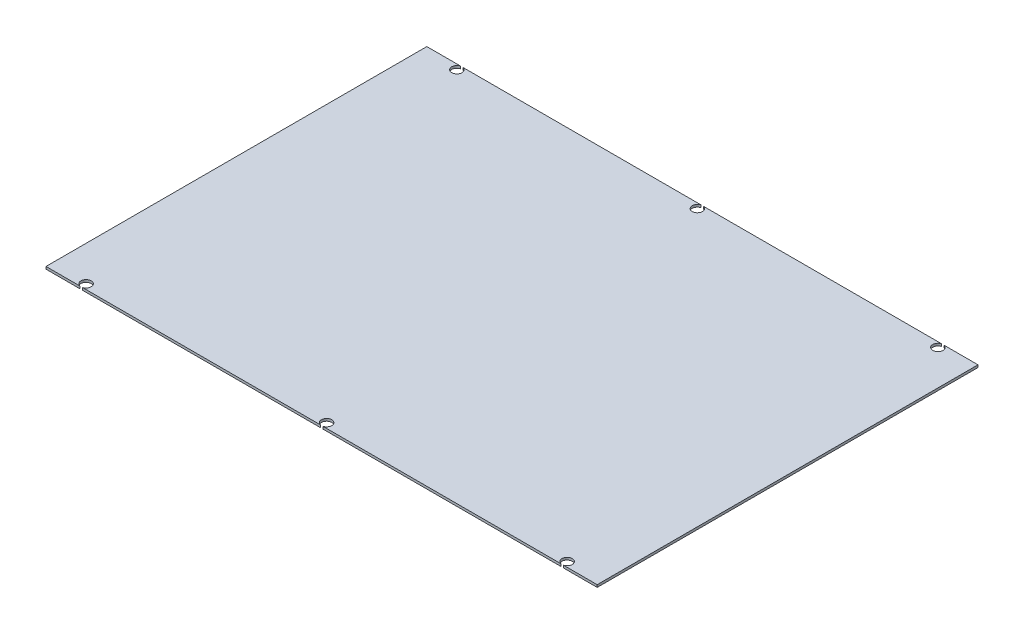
ISO-10303-21;
HEADER;
FILE_DESCRIPTION(('STEP AP214'),'2;1');
FILE_NAME('part.step','',(''),(''),'','','');
FILE_SCHEMA(('AUTOMOTIVE_DESIGN { 1 0 10303 214 1 1 1 1 }'));
ENDSEC;
DATA;
#1=APPLICATION_CONTEXT('core data for automotive mechanical design processes');
#2=APPLICATION_PROTOCOL_DEFINITION('international standard','automotive_design',2000,#1);
#3=PRODUCT_CONTEXT('',#1,'mechanical');
#4=PRODUCT('Part','Part','',(#3));
#5=PRODUCT_RELATED_PRODUCT_CATEGORY('part','',(#4));
#6=PRODUCT_DEFINITION_FORMATION('','',#4);
#7=PRODUCT_DEFINITION_CONTEXT('part definition',#1,'design');
#8=PRODUCT_DEFINITION('design','',#6,#7);
#9=PRODUCT_DEFINITION_SHAPE('','',#8);
#10=(LENGTH_UNIT() NAMED_UNIT(*) SI_UNIT(.MILLI.,.METRE.));
#11=(NAMED_UNIT(*) PLANE_ANGLE_UNIT() SI_UNIT($,.RADIAN.));
#12=(NAMED_UNIT(*) SI_UNIT($,.STERADIAN.) SOLID_ANGLE_UNIT());
#13=UNCERTAINTY_MEASURE_WITH_UNIT(LENGTH_MEASURE(1.E-05),#10,'distance_accuracy_value','');
#14=(GEOMETRIC_REPRESENTATION_CONTEXT(3) GLOBAL_UNCERTAINTY_ASSIGNED_CONTEXT((#13)) GLOBAL_UNIT_ASSIGNED_CONTEXT((#10,
#11,#12)) REPRESENTATION_CONTEXT('',''));
#15=CARTESIAN_POINT('',(0.,0.,0.));
#16=DIRECTION('',(0.,0.,1.));
#17=DIRECTION('',(1.,0.,0.));
#18=AXIS2_PLACEMENT_3D('',#15,#16,#17);
#19=CARTESIAN_POINT('',(0.,0.761999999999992,0.));
#20=DIRECTION('',(0.,0.,-1.));
#21=DIRECTION('',(-1.,0.,0.));
#22=AXIS2_PLACEMENT_3D('',#19,#20,#21);
#23=PLANE('',#22);
#24=DIRECTION('',(1.,0.,0.));
#25=VECTOR('',#24,1.);
#26=CARTESIAN_POINT('',(0.,0.,0.));
#27=LINE('',#26,#25);
#28=CARTESIAN_POINT('',(0.,0.,0.));
#29=VERTEX_POINT('',#28);
#30=CARTESIAN_POINT('',(10.7342083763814,0.,0.));
#31=VERTEX_POINT('',#30);
#32=EDGE_CURVE('E179',#29,#31,#27,.T.);
#33=ORIENTED_EDGE('',*,*,#32,.T.);
#34=DIRECTION('',(0.,1.,0.));
#35=VECTOR('',#34,1.);
#36=CARTESIAN_POINT('',(10.7342083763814,0.761999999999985,0.));
#37=LINE('',#36,#35);
#38=CARTESIAN_POINT('',(10.7342083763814,0.761999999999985,0.));
#39=VERTEX_POINT('',#38);
#40=EDGE_CURVE('E44',#31,#39,#37,.T.);
#41=ORIENTED_EDGE('',*,*,#40,.T.);
#42=DIRECTION('',(1.,0.,0.));
#43=VECTOR('',#42,1.);
#44=CARTESIAN_POINT('',(0.,0.761999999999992,0.));
#45=LINE('',#44,#43);
#46=CARTESIAN_POINT('',(0.,0.761999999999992,0.));
#47=VERTEX_POINT('',#46);
#48=EDGE_CURVE('E154',#47,#39,#45,.T.);
#49=ORIENTED_EDGE('',*,*,#48,.F.);
#50=DIRECTION('',(0.,-1.,0.));
#51=VECTOR('',#50,1.);
#52=CARTESIAN_POINT('',(0.,0.761999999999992,0.));
#53=LINE('',#52,#51);
#54=EDGE_CURVE('E198',#47,#29,#53,.T.);
#55=ORIENTED_EDGE('',*,*,#54,.T.);
#56=EDGE_LOOP('',(#33,#41,#49,#55));
#57=FACE_BOUND('',#56,.T.);
#58=ADVANCED_FACE('F30',(#57),#23,.F.);
#59=CARTESIAN_POINT('',(11.4907916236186,0.761999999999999,-4.44089209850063E-13));
#60=VERTEX_POINT('',#59);
#61=CARTESIAN_POINT('',(86.9342083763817,0.761999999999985,0.));
#62=VERTEX_POINT('',#61);
#63=EDGE_CURVE('E151',#60,#62,#45,.T.);
#64=ORIENTED_EDGE('',*,*,#63,.F.);
#65=DIRECTION('',(0.,1.,0.));
#66=VECTOR('',#65,1.);
#67=CARTESIAN_POINT('',(11.4907916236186,0.762000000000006,-4.44089209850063E-13));
#68=LINE('',#67,#66);
#69=CARTESIAN_POINT('',(11.4907916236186,0.,0.));
#70=VERTEX_POINT('',#69);
#71=EDGE_CURVE('E141',#60,#70,#68,.F.);
#72=ORIENTED_EDGE('',*,*,#71,.T.);
#73=CARTESIAN_POINT('',(86.9342083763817,0.,0.));
#74=VERTEX_POINT('',#73);
#75=EDGE_CURVE('E52',#70,#74,#27,.T.);
#76=ORIENTED_EDGE('',*,*,#75,.T.);
#77=DIRECTION('',(0.,1.,0.));
#78=VECTOR('',#77,1.);
#79=CARTESIAN_POINT('',(86.9342083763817,0.761999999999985,0.));
#80=LINE('',#79,#78);
#81=EDGE_CURVE('E157',#74,#62,#80,.T.);
#82=ORIENTED_EDGE('',*,*,#81,.T.);
#83=EDGE_LOOP('',(#64,#72,#76,#82));
#84=FACE_BOUND('',#83,.T.);
#85=ADVANCED_FACE('F156',(#84),#23,.F.);
#86=CARTESIAN_POINT('',(87.6907916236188,0.761999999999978,0.));
#87=VERTEX_POINT('',#86);
#88=CARTESIAN_POINT('',(163.134208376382,0.762000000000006,0.));
#89=VERTEX_POINT('',#88);
#90=EDGE_CURVE('E158',#87,#89,#45,.T.);
#91=ORIENTED_EDGE('',*,*,#90,.F.);
#92=DIRECTION('',(0.,1.,0.));
#93=VECTOR('',#92,1.);
#94=CARTESIAN_POINT('',(87.6907916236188,0.761999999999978,0.));
#95=LINE('',#94,#93);
#96=CARTESIAN_POINT('',(87.6907916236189,0.,0.));
#97=VERTEX_POINT('',#96);
#98=EDGE_CURVE('E212',#87,#97,#95,.F.);
#99=ORIENTED_EDGE('',*,*,#98,.T.);
#100=CARTESIAN_POINT('',(163.134208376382,0.,0.));
#101=VERTEX_POINT('',#100);
#102=EDGE_CURVE('E219',#97,#101,#27,.T.);
#103=ORIENTED_EDGE('',*,*,#102,.T.);
#104=DIRECTION('',(0.,1.,0.));
#105=VECTOR('',#104,1.);
#106=CARTESIAN_POINT('',(163.134208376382,0.762000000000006,0.));
#107=LINE('',#106,#105);
#108=EDGE_CURVE('E266',#101,#89,#107,.T.);
#109=ORIENTED_EDGE('',*,*,#108,.T.);
#110=EDGE_LOOP('',(#91,#99,#103,#109));
#111=FACE_BOUND('',#110,.T.);
#112=ADVANCED_FACE('F217',(#111),#23,.F.);
#113=CARTESIAN_POINT('',(0.,0.761999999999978,-120.65));
#114=DIRECTION('',(0.,0.,1.));
#115=DIRECTION('',(1.,0.,0.));
#116=AXIS2_PLACEMENT_3D('',#113,#114,#115);
#117=PLANE('',#116);
#118=DIRECTION('',(-1.,0.,0.));
#119=VECTOR('',#118,1.);
#120=CARTESIAN_POINT('',(0.,0.,-120.65));
#121=LINE('',#120,#119);
#122=CARTESIAN_POINT('',(163.134208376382,0.,-120.65));
#123=VERTEX_POINT('',#122);
#124=CARTESIAN_POINT('',(87.690791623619,0.,-120.65));
#125=VERTEX_POINT('',#124);
#126=EDGE_CURVE('E188',#123,#125,#121,.T.);
#127=ORIENTED_EDGE('',*,*,#126,.T.);
#128=DIRECTION('',(0.,1.,0.));
#129=VECTOR('',#128,1.);
#130=CARTESIAN_POINT('',(87.6907916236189,0.76200000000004,-120.65));
#131=LINE('',#130,#129);
#132=CARTESIAN_POINT('',(87.6907916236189,0.76200000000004,-120.65));
#133=VERTEX_POINT('',#132);
#134=EDGE_CURVE('E273',#125,#133,#131,.T.);
#135=ORIENTED_EDGE('',*,*,#134,.T.);
#136=DIRECTION('',(-1.,0.,0.));
#137=VECTOR('',#136,1.);
#138=CARTESIAN_POINT('',(0.,0.761999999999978,-120.65));
#139=LINE('',#138,#137);
#140=CARTESIAN_POINT('',(163.134208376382,0.761999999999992,-120.65));
#141=VERTEX_POINT('',#140);
#142=EDGE_CURVE('E172',#141,#133,#139,.T.);
#143=ORIENTED_EDGE('',*,*,#142,.F.);
#144=DIRECTION('',(0.,1.,0.));
#145=VECTOR('',#144,1.);
#146=CARTESIAN_POINT('',(163.134208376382,0.761999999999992,-120.65));
#147=LINE('',#146,#145);
#148=EDGE_CURVE('E277',#141,#123,#147,.F.);
#149=ORIENTED_EDGE('',*,*,#148,.T.);
#150=EDGE_LOOP('',(#127,#135,#143,#149));
#151=FACE_BOUND('',#150,.T.);
#152=ADVANCED_FACE('F300',(#151),#117,.F.);
#153=CARTESIAN_POINT('',(174.625000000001,0.,-120.65));
#154=VERTEX_POINT('',#153);
#155=CARTESIAN_POINT('',(163.890791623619,0.,-120.65));
#156=VERTEX_POINT('',#155);
#157=EDGE_CURVE('E185',#154,#156,#121,.T.);
#158=ORIENTED_EDGE('',*,*,#157,.T.);
#159=DIRECTION('',(0.,1.,0.));
#160=VECTOR('',#159,1.);
#161=CARTESIAN_POINT('',(163.890791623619,0.761999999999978,-120.65));
#162=LINE('',#161,#160);
#163=CARTESIAN_POINT('',(163.890791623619,0.761999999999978,-120.65));
#164=VERTEX_POINT('',#163);
#165=EDGE_CURVE('E244',#156,#164,#162,.T.);
#166=ORIENTED_EDGE('',*,*,#165,.T.);
#167=CARTESIAN_POINT('',(174.625000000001,0.761999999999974,-120.65));
#168=VERTEX_POINT('',#167);
#169=EDGE_CURVE('E168',#168,#164,#139,.T.);
#170=ORIENTED_EDGE('',*,*,#169,.F.);
#171=DIRECTION('',(0.,-1.,0.));
#172=VECTOR('',#171,1.);
#173=CARTESIAN_POINT('',(174.625000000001,0.761999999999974,-120.65));
#174=LINE('',#173,#172);
#175=EDGE_CURVE('E192',#168,#154,#174,.T.);
#176=ORIENTED_EDGE('',*,*,#175,.T.);
#177=EDGE_LOOP('',(#158,#166,#170,#176));
#178=FACE_BOUND('',#177,.T.);
#179=ADVANCED_FACE('F242',(#178),#117,.F.);
#180=CARTESIAN_POINT('',(86.9342083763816,0.761999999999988,-120.65));
#181=VERTEX_POINT('',#180);
#182=CARTESIAN_POINT('',(11.4907916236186,0.761999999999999,-120.65));
#183=VERTEX_POINT('',#182);
#184=EDGE_CURVE('E173',#181,#183,#139,.T.);
#185=ORIENTED_EDGE('',*,*,#184,.F.);
#186=DIRECTION('',(0.,1.,0.));
#187=VECTOR('',#186,1.);
#188=CARTESIAN_POINT('',(86.9342083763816,0.761999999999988,-120.65));
#189=LINE('',#188,#187);
#190=CARTESIAN_POINT('',(86.9342083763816,0.,-120.65));
#191=VERTEX_POINT('',#190);
#192=EDGE_CURVE('E270',#181,#191,#189,.F.);
#193=ORIENTED_EDGE('',*,*,#192,.T.);
#194=CARTESIAN_POINT('',(11.4907916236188,0.,-120.65));
#195=VERTEX_POINT('',#194);
#196=EDGE_CURVE('E189',#191,#195,#121,.T.);
#197=ORIENTED_EDGE('',*,*,#196,.T.);
#198=DIRECTION('',(0.,1.,0.));
#199=VECTOR('',#198,1.);
#200=CARTESIAN_POINT('',(11.4907916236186,0.761999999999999,-120.65));
#201=LINE('',#200,#199);
#202=EDGE_CURVE('E178',#195,#183,#201,.T.);
#203=ORIENTED_EDGE('',*,*,#202,.T.);
#204=EDGE_LOOP('',(#185,#193,#197,#203));
#205=FACE_BOUND('',#204,.T.);
#206=ADVANCED_FACE('F290',(#205),#117,.F.);
#207=CARTESIAN_POINT('',(0.,0.761999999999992,0.));
#208=DIRECTION('',(1.,0.,0.));
#209=DIRECTION('',(0.,0.,-1.));
#210=AXIS2_PLACEMENT_3D('',#207,#208,#209);
#211=PLANE('',#210);
#212=DIRECTION('',(0.,0.,1.));
#213=VECTOR('',#212,1.);
#214=CARTESIAN_POINT('',(0.,0.,0.));
#215=LINE('',#214,#213);
#216=CARTESIAN_POINT('',(0.,0.,-120.65));
#217=VERTEX_POINT('',#216);
#218=EDGE_CURVE('E174',#217,#29,#215,.T.);
#219=ORIENTED_EDGE('',*,*,#218,.T.);
#220=ORIENTED_EDGE('',*,*,#54,.F.);
#221=DIRECTION('',(0.,0.,1.));
#222=VECTOR('',#221,1.);
#223=CARTESIAN_POINT('',(0.,0.761999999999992,0.));
#224=LINE('',#223,#222);
#225=CARTESIAN_POINT('',(0.,0.761999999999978,-120.65));
#226=VERTEX_POINT('',#225);
#227=EDGE_CURVE('E164',#226,#47,#224,.T.);
#228=ORIENTED_EDGE('',*,*,#227,.F.);
#229=DIRECTION('',(0.,-1.,0.));
#230=VECTOR('',#229,1.);
#231=CARTESIAN_POINT('',(0.,0.761999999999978,-120.65));
#232=LINE('',#231,#230);
#233=EDGE_CURVE('E171',#226,#217,#232,.T.);
#234=ORIENTED_EDGE('',*,*,#233,.T.);
#235=EDGE_LOOP('',(#219,#220,#228,#234));
#236=FACE_BOUND('',#235,.T.);
#237=ADVANCED_FACE('F32',(#236),#211,.F.);
#238=CARTESIAN_POINT('',(163.890791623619,0.761999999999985,0.));
#239=VERTEX_POINT('',#238);
#240=CARTESIAN_POINT('',(174.625000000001,0.761999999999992,0.));
#241=VERTEX_POINT('',#240);
#242=EDGE_CURVE('E161',#239,#241,#45,.T.);
#243=ORIENTED_EDGE('',*,*,#242,.F.);
#244=DIRECTION('',(0.,1.,0.));
#245=VECTOR('',#244,1.);
#246=CARTESIAN_POINT('',(163.890791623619,0.761999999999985,0.));
#247=LINE('',#246,#245);
#248=CARTESIAN_POINT('',(163.890791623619,0.,0.));
#249=VERTEX_POINT('',#248);
#250=EDGE_CURVE('E232',#239,#249,#247,.F.);
#251=ORIENTED_EDGE('',*,*,#250,.T.);
#252=CARTESIAN_POINT('',(174.625000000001,0.,-4.44089209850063E-13));
#253=VERTEX_POINT('',#252);
#254=EDGE_CURVE('E177',#249,#253,#27,.T.);
#255=ORIENTED_EDGE('',*,*,#254,.T.);
#256=DIRECTION('',(0.,-1.,0.));
#257=VECTOR('',#256,1.);
#258=CARTESIAN_POINT('',(174.625000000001,0.761999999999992,0.));
#259=LINE('',#258,#257);
#260=EDGE_CURVE('E195',#241,#253,#259,.T.);
#261=ORIENTED_EDGE('',*,*,#260,.F.);
#262=EDGE_LOOP('',(#243,#251,#255,#261));
#263=FACE_BOUND('',#262,.T.);
#264=ADVANCED_FACE('F230',(#263),#23,.F.);
#265=CARTESIAN_POINT('',(174.625000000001,0.761999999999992,0.));
#266=DIRECTION('',(-1.,0.,0.));
#267=DIRECTION('',(0.,0.,1.));
#268=AXIS2_PLACEMENT_3D('',#265,#266,#267);
#269=PLANE('',#268);
#270=DIRECTION('',(0.,0.,-1.));
#271=VECTOR('',#270,1.);
#272=CARTESIAN_POINT('',(174.625000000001,0.,-4.44089209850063E-13));
#273=LINE('',#272,#271);
#274=EDGE_CURVE('E182',#253,#154,#273,.T.);
#275=ORIENTED_EDGE('',*,*,#274,.T.);
#276=ORIENTED_EDGE('',*,*,#175,.F.);
#277=DIRECTION('',(0.,0.,-1.));
#278=VECTOR('',#277,1.);
#279=CARTESIAN_POINT('',(174.625000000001,0.761999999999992,0.));
#280=LINE('',#279,#278);
#281=EDGE_CURVE('E160',#241,#168,#280,.T.);
#282=ORIENTED_EDGE('',*,*,#281,.F.);
#283=ORIENTED_EDGE('',*,*,#260,.T.);
#284=EDGE_LOOP('',(#275,#276,#282,#283));
#285=FACE_BOUND('',#284,.T.);
#286=ADVANCED_FACE('F235',(#285),#269,.F.);
#287=CARTESIAN_POINT('',(10.7342083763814,0.761999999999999,-120.65));
#288=VERTEX_POINT('',#287);
#289=EDGE_CURVE('E167',#288,#226,#139,.T.);
#290=ORIENTED_EDGE('',*,*,#289,.F.);
#291=DIRECTION('',(0.,1.,0.));
#292=VECTOR('',#291,1.);
#293=CARTESIAN_POINT('',(10.7342083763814,0.761999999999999,-120.65));
#294=LINE('',#293,#292);
#295=CARTESIAN_POINT('',(10.7342083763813,0.,-120.65));
#296=VERTEX_POINT('',#295);
#297=EDGE_CURVE('E284',#288,#296,#294,.F.);
#298=ORIENTED_EDGE('',*,*,#297,.T.);
#299=EDGE_CURVE('E184',#296,#217,#121,.T.);
#300=ORIENTED_EDGE('',*,*,#299,.T.);
#301=ORIENTED_EDGE('',*,*,#233,.F.);
#302=EDGE_LOOP('',(#290,#298,#300,#301));
#303=FACE_BOUND('',#302,.T.);
#304=ADVANCED_FACE('F304',(#303),#117,.F.);
#305=CARTESIAN_POINT('',(0.,0.761999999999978,-120.65));
#306=DIRECTION('',(0.,-1.,0.));
#307=DIRECTION('',(0.,0.,-1.));
#308=AXIS2_PLACEMENT_3D('',#305,#306,#307);
#309=PLANE('',#308);
#310=ORIENTED_EDGE('',*,*,#48,.T.);
#311=CARTESIAN_POINT('',(11.1125,0.762000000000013,-1.58750000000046));
#312=DIRECTION('',(0.,1.,0.));
#313=DIRECTION('',(0.,0.,1.));
#314=AXIS2_PLACEMENT_3D('',#311,#312,#313);
#315=CIRCLE('',#314,1.63195);
#316=EDGE_CURVE('E144',#60,#39,#315,.T.);
#317=ORIENTED_EDGE('',*,*,#316,.F.);
#318=ORIENTED_EDGE('',*,*,#63,.T.);
#319=CARTESIAN_POINT('',(87.3125000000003,0.761999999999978,-1.58750000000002));
#320=DIRECTION('',(0.,1.,0.));
#321=DIRECTION('',(0.,0.,1.));
#322=AXIS2_PLACEMENT_3D('',#319,#320,#321);
#323=CIRCLE('',#322,1.63194999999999);
#324=EDGE_CURVE('E221',#87,#62,#323,.T.);
#325=ORIENTED_EDGE('',*,*,#324,.F.);
#326=ORIENTED_EDGE('',*,*,#90,.T.);
#327=CARTESIAN_POINT('',(163.5125,0.761999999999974,-1.58750000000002));
#328=DIRECTION('',(0.,1.,0.));
#329=DIRECTION('',(0.,0.,1.));
#330=AXIS2_PLACEMENT_3D('',#327,#328,#329);
#331=CIRCLE('',#330,1.63194999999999);
#332=EDGE_CURVE('E251',#239,#89,#331,.T.);
#333=ORIENTED_EDGE('',*,*,#332,.F.);
#334=ORIENTED_EDGE('',*,*,#242,.T.);
#335=ORIENTED_EDGE('',*,*,#281,.T.);
#336=ORIENTED_EDGE('',*,*,#169,.T.);
#337=CARTESIAN_POINT('',(163.512500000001,0.761999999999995,-119.0625));
#338=DIRECTION('',(0.,1.,0.));
#339=DIRECTION('',(0.,0.,1.));
#340=AXIS2_PLACEMENT_3D('',#337,#338,#339);
#341=CIRCLE('',#340,1.63194999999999);
#342=EDGE_CURVE('E247',#141,#164,#341,.T.);
#343=ORIENTED_EDGE('',*,*,#342,.F.);
#344=ORIENTED_EDGE('',*,*,#142,.T.);
#345=CARTESIAN_POINT('',(87.3125000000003,0.761999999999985,-119.0625));
#346=DIRECTION('',(0.,1.,0.));
#347=DIRECTION('',(0.,0.,1.));
#348=AXIS2_PLACEMENT_3D('',#345,#346,#347);
#349=CIRCLE('',#348,1.63194999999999);
#350=EDGE_CURVE('E268',#181,#133,#349,.T.);
#351=ORIENTED_EDGE('',*,*,#350,.F.);
#352=ORIENTED_EDGE('',*,*,#184,.T.);
#353=CARTESIAN_POINT('',(11.1125,0.762000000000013,-119.0625));
#354=DIRECTION('',(0.,1.,0.));
#355=DIRECTION('',(0.,0.,1.));
#356=AXIS2_PLACEMENT_3D('',#353,#354,#355);
#357=CIRCLE('',#356,1.63195);
#358=EDGE_CURVE('E281',#288,#183,#357,.T.);
#359=ORIENTED_EDGE('',*,*,#358,.F.);
#360=ORIENTED_EDGE('',*,*,#289,.T.);
#361=ORIENTED_EDGE('',*,*,#227,.T.);
#362=EDGE_LOOP('',(#310,#317,#318,#325,#326,#333,#334,#335,#336,#343,#344,#351,#352,#359,#360,#361));
#363=FACE_BOUND('',#362,.T.);
#364=ADVANCED_FACE('F149',(#363),#309,.F.);
#365=CARTESIAN_POINT('',(0.,0.,-120.65));
#366=DIRECTION('',(0.,-1.,0.));
#367=DIRECTION('',(0.,0.,-1.));
#368=AXIS2_PLACEMENT_3D('',#365,#366,#367);
#369=PLANE('',#368);
#370=CARTESIAN_POINT('',(11.1125000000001,0.,-1.58750000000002));
#371=DIRECTION('',(0.,-1.,0.));
#372=DIRECTION('',(0.,0.,-1.));
#373=AXIS2_PLACEMENT_3D('',#370,#371,#372);
#374=CIRCLE('',#373,1.63195);
#375=EDGE_CURVE('E11',#31,#70,#374,.T.);
#376=ORIENTED_EDGE('',*,*,#375,.F.);
#377=ORIENTED_EDGE('',*,*,#32,.F.);
#378=ORIENTED_EDGE('',*,*,#218,.F.);
#379=ORIENTED_EDGE('',*,*,#299,.F.);
#380=CARTESIAN_POINT('',(11.1125000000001,0.,-119.0625));
#381=DIRECTION('',(0.,-1.,0.));
#382=DIRECTION('',(0.,0.,-1.));
#383=AXIS2_PLACEMENT_3D('',#380,#381,#382);
#384=CIRCLE('',#383,1.63195);
#385=EDGE_CURVE('E201',#195,#296,#384,.T.);
#386=ORIENTED_EDGE('',*,*,#385,.F.);
#387=ORIENTED_EDGE('',*,*,#196,.F.);
#388=CARTESIAN_POINT('',(87.3125000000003,0.,-119.0625));
#389=DIRECTION('',(0.,-1.,0.));
#390=DIRECTION('',(0.,0.,-1.));
#391=AXIS2_PLACEMENT_3D('',#388,#389,#390);
#392=CIRCLE('',#391,1.63194999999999);
#393=EDGE_CURVE('E205',#125,#191,#392,.T.);
#394=ORIENTED_EDGE('',*,*,#393,.F.);
#395=ORIENTED_EDGE('',*,*,#126,.F.);
#396=CARTESIAN_POINT('',(163.512500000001,0.,-119.0625));
#397=DIRECTION('',(0.,-1.,0.));
#398=DIRECTION('',(0.,0.,-1.));
#399=AXIS2_PLACEMENT_3D('',#396,#397,#398);
#400=CIRCLE('',#399,1.63194999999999);
#401=EDGE_CURVE('E203',#156,#123,#400,.T.);
#402=ORIENTED_EDGE('',*,*,#401,.F.);
#403=ORIENTED_EDGE('',*,*,#157,.F.);
#404=ORIENTED_EDGE('',*,*,#274,.F.);
#405=ORIENTED_EDGE('',*,*,#254,.F.);
#406=CARTESIAN_POINT('',(163.512500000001,0.,-1.58750000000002));
#407=DIRECTION('',(0.,-1.,0.));
#408=DIRECTION('',(0.,0.,-1.));
#409=AXIS2_PLACEMENT_3D('',#406,#407,#408);
#410=CIRCLE('',#409,1.63194999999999);
#411=EDGE_CURVE('E207',#101,#249,#410,.T.);
#412=ORIENTED_EDGE('',*,*,#411,.F.);
#413=ORIENTED_EDGE('',*,*,#102,.F.);
#414=CARTESIAN_POINT('',(87.3125000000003,0.,-1.58750000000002));
#415=DIRECTION('',(0.,-1.,0.));
#416=DIRECTION('',(0.,0.,-1.));
#417=AXIS2_PLACEMENT_3D('',#414,#415,#416);
#418=CIRCLE('',#417,1.63194999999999);
#419=EDGE_CURVE('E38',#74,#97,#418,.T.);
#420=ORIENTED_EDGE('',*,*,#419,.F.);
#421=ORIENTED_EDGE('',*,*,#75,.F.);
#422=EDGE_LOOP('',(#376,#377,#378,#379,#386,#387,#394,#395,#402,#403,#404,#405,#412,#413,#420,#421));
#423=FACE_BOUND('',#422,.T.);
#424=ADVANCED_FACE('F224',(#423),#369,.T.);
#425=CARTESIAN_POINT('',(11.1125,0.762000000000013,-119.0625));
#426=DIRECTION('',(0.,1.,0.));
#427=DIRECTION('',(0.,0.,1.));
#428=AXIS2_PLACEMENT_3D('',#425,#426,#427);
#429=CYLINDRICAL_SURFACE('',#428,1.63195);
#430=ORIENTED_EDGE('',*,*,#385,.T.);
#431=ORIENTED_EDGE('',*,*,#297,.F.);
#432=ORIENTED_EDGE('',*,*,#358,.T.);
#433=ORIENTED_EDGE('',*,*,#202,.F.);
#434=EDGE_LOOP('',(#430,#431,#432,#433));
#435=FACE_BOUND('',#434,.T.);
#436=ADVANCED_FACE('F294',(#435),#429,.F.);
#437=CARTESIAN_POINT('',(163.512500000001,0.761999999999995,-119.0625));
#438=DIRECTION('',(0.,1.,0.));
#439=DIRECTION('',(0.,0.,1.));
#440=AXIS2_PLACEMENT_3D('',#437,#438,#439);
#441=CYLINDRICAL_SURFACE('',#440,1.63194999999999);
#442=ORIENTED_EDGE('',*,*,#401,.T.);
#443=ORIENTED_EDGE('',*,*,#148,.F.);
#444=ORIENTED_EDGE('',*,*,#342,.T.);
#445=ORIENTED_EDGE('',*,*,#165,.F.);
#446=EDGE_LOOP('',(#442,#443,#444,#445));
#447=FACE_BOUND('',#446,.T.);
#448=ADVANCED_FACE('F369',(#447),#441,.F.);
#449=CARTESIAN_POINT('',(87.3125000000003,0.761999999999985,-119.0625));
#450=DIRECTION('',(0.,1.,0.));
#451=DIRECTION('',(0.,0.,1.));
#452=AXIS2_PLACEMENT_3D('',#449,#450,#451);
#453=CYLINDRICAL_SURFACE('',#452,1.63194999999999);
#454=ORIENTED_EDGE('',*,*,#393,.T.);
#455=ORIENTED_EDGE('',*,*,#192,.F.);
#456=ORIENTED_EDGE('',*,*,#350,.T.);
#457=ORIENTED_EDGE('',*,*,#134,.F.);
#458=EDGE_LOOP('',(#454,#455,#456,#457));
#459=FACE_BOUND('',#458,.T.);
#460=ADVANCED_FACE('F302',(#459),#453,.F.);
#461=CARTESIAN_POINT('',(163.5125,0.761999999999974,-1.58750000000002));
#462=DIRECTION('',(0.,1.,0.));
#463=DIRECTION('',(0.,0.,1.));
#464=AXIS2_PLACEMENT_3D('',#461,#462,#463);
#465=CYLINDRICAL_SURFACE('',#464,1.63194999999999);
#466=ORIENTED_EDGE('',*,*,#411,.T.);
#467=ORIENTED_EDGE('',*,*,#250,.F.);
#468=ORIENTED_EDGE('',*,*,#332,.T.);
#469=ORIENTED_EDGE('',*,*,#108,.F.);
#470=EDGE_LOOP('',(#466,#467,#468,#469));
#471=FACE_BOUND('',#470,.T.);
#472=ADVANCED_FACE('F383',(#471),#465,.F.);
#473=CARTESIAN_POINT('',(87.3125000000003,0.761999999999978,-1.58750000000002));
#474=DIRECTION('',(0.,1.,0.));
#475=DIRECTION('',(0.,0.,1.));
#476=AXIS2_PLACEMENT_3D('',#473,#474,#475);
#477=CYLINDRICAL_SURFACE('',#476,1.63194999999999);
#478=ORIENTED_EDGE('',*,*,#419,.T.);
#479=ORIENTED_EDGE('',*,*,#98,.F.);
#480=ORIENTED_EDGE('',*,*,#324,.T.);
#481=ORIENTED_EDGE('',*,*,#81,.F.);
#482=EDGE_LOOP('',(#478,#479,#480,#481));
#483=FACE_BOUND('',#482,.T.);
#484=ADVANCED_FACE('F211',(#483),#477,.F.);
#485=CARTESIAN_POINT('',(11.1125,0.762000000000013,-1.58750000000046));
#486=DIRECTION('',(0.,1.,0.));
#487=DIRECTION('',(0.,0.,1.));
#488=AXIS2_PLACEMENT_3D('',#485,#486,#487);
#489=CYLINDRICAL_SURFACE('',#488,1.63195);
#490=ORIENTED_EDGE('',*,*,#375,.T.);
#491=ORIENTED_EDGE('',*,*,#71,.F.);
#492=ORIENTED_EDGE('',*,*,#316,.T.);
#493=ORIENTED_EDGE('',*,*,#40,.F.);
#494=EDGE_LOOP('',(#490,#491,#492,#493));
#495=FACE_BOUND('',#494,.T.);
#496=ADVANCED_FACE('F143',(#495),#489,.F.);
#497=CLOSED_SHELL('',(#58,#85,#112,#152,#179,#206,#237,#264,#286,#304,#364,#424,#436,#448,#460,
#472,#484,#496));
#498=MANIFOLD_SOLID_BREP('B2',#497);
#499=ADVANCED_BREP_SHAPE_REPRESENTATION('',(#18,#498),#14);
#500=SHAPE_DEFINITION_REPRESENTATION(#9,#499);
ENDSEC;
END-ISO-10303-21;
